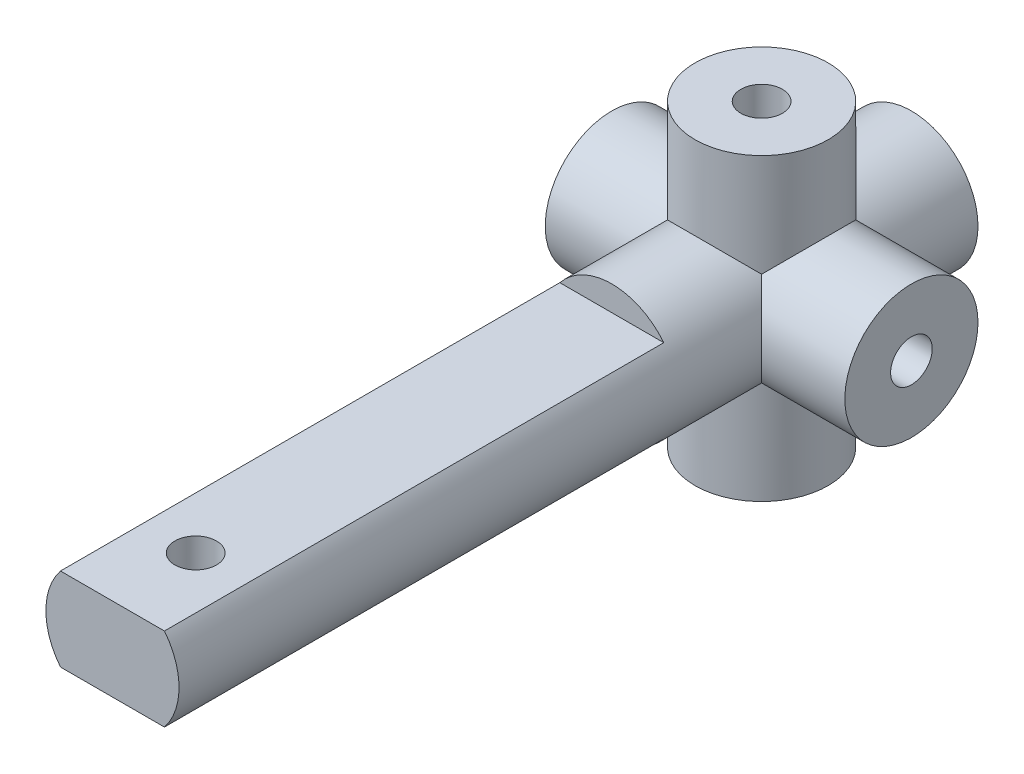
ISO-10303-21;
HEADER;
FILE_DESCRIPTION(('STEP AP214'),'2;1');
FILE_NAME('part.step','',(''),(''),'','','');
FILE_SCHEMA(('AUTOMOTIVE_DESIGN { 1 0 10303 214 1 1 1 1 }'));
ENDSEC;
DATA;
#1=APPLICATION_CONTEXT('core data for automotive mechanical design processes');
#2=APPLICATION_PROTOCOL_DEFINITION('international standard','automotive_design',2000,#1);
#3=PRODUCT_CONTEXT('',#1,'mechanical');
#4=PRODUCT('Part','Part','',(#3));
#5=PRODUCT_RELATED_PRODUCT_CATEGORY('part','',(#4));
#6=PRODUCT_DEFINITION_FORMATION('','',#4);
#7=PRODUCT_DEFINITION_CONTEXT('part definition',#1,'design');
#8=PRODUCT_DEFINITION('design','',#6,#7);
#9=PRODUCT_DEFINITION_SHAPE('','',#8);
#10=(LENGTH_UNIT() NAMED_UNIT(*) SI_UNIT(.MILLI.,.METRE.));
#11=(NAMED_UNIT(*) PLANE_ANGLE_UNIT() SI_UNIT($,.RADIAN.));
#12=(NAMED_UNIT(*) SI_UNIT($,.STERADIAN.) SOLID_ANGLE_UNIT());
#13=UNCERTAINTY_MEASURE_WITH_UNIT(LENGTH_MEASURE(1.E-05),#10,'distance_accuracy_value','');
#14=(GEOMETRIC_REPRESENTATION_CONTEXT(3) GLOBAL_UNCERTAINTY_ASSIGNED_CONTEXT((#13)) GLOBAL_UNIT_ASSIGNED_CONTEXT((#10,
#11,#12)) REPRESENTATION_CONTEXT('',''));
#15=CARTESIAN_POINT('',(0.,0.,0.));
#16=DIRECTION('',(0.,0.,1.));
#17=DIRECTION('',(1.,0.,0.));
#18=AXIS2_PLACEMENT_3D('',#15,#16,#17);
#19=CARTESIAN_POINT('',(0.,0.,9.));
#20=DIRECTION('',(0.,0.,-1.));
#21=DIRECTION('',(-1.,0.,0.));
#22=AXIS2_PLACEMENT_3D('',#19,#20,#21);
#23=CYLINDRICAL_SURFACE('',#22,4.);
#24=CARTESIAN_POINT('',(0.,0.,0.));
#25=DIRECTION('',(-0.707106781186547,0.,0.707106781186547));
#26=DIRECTION('',(-0.707106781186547,0.,-0.707106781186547));
#27=AXIS2_PLACEMENT_3D('',#24,#25,#26);
#28=ELLIPSE('',#27,5.65685424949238,4.);
#29=CARTESIAN_POINT('',(2.82842712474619,-2.82842712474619,2.82842712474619));
#30=VERTEX_POINT('',#29);
#31=CARTESIAN_POINT('',(2.82842712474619,2.82842712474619,2.82842712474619));
#32=VERTEX_POINT('',#31);
#33=EDGE_CURVE('E208',#30,#32,#28,.T.);
#34=ORIENTED_EDGE('',*,*,#33,.T.);
#35=CARTESIAN_POINT('',(0.,0.,0.));
#36=DIRECTION('',(0.,-0.707106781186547,0.707106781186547));
#37=DIRECTION('',(0.,-0.707106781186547,-0.707106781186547));
#38=AXIS2_PLACEMENT_3D('',#35,#36,#37);
#39=ELLIPSE('',#38,5.65685424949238,4.);
#40=CARTESIAN_POINT('',(-2.82842712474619,2.82842712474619,2.82842712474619));
#41=VERTEX_POINT('',#40);
#42=EDGE_CURVE('E214',#32,#41,#39,.T.);
#43=ORIENTED_EDGE('',*,*,#42,.T.);
#44=CARTESIAN_POINT('',(0.,0.,0.));
#45=DIRECTION('',(-0.707106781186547,0.,-0.707106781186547));
#46=DIRECTION('',(-0.707106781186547,0.,0.707106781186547));
#47=AXIS2_PLACEMENT_3D('',#44,#45,#46);
#48=ELLIPSE('',#47,5.65685424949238,4.);
#49=CARTESIAN_POINT('',(-2.82842712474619,-2.82842712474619,2.82842712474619));
#50=VERTEX_POINT('',#49);
#51=EDGE_CURVE('E211',#41,#50,#48,.F.);
#52=ORIENTED_EDGE('',*,*,#51,.T.);
#53=CARTESIAN_POINT('',(0.,0.,0.));
#54=DIRECTION('',(0.,-0.707106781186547,-0.707106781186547));
#55=DIRECTION('',(0.,-0.707106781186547,0.707106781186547));
#56=AXIS2_PLACEMENT_3D('',#53,#54,#55);
#57=ELLIPSE('',#56,5.65685424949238,4.);
#58=EDGE_CURVE('E205',#50,#30,#57,.F.);
#59=ORIENTED_EDGE('',*,*,#58,.T.);
#60=EDGE_LOOP('',(#34,#43,#52,#59));
#61=FACE_BOUND('',#60,.T.);
#62=DIRECTION('',(0.,0.,1.));
#63=VECTOR('',#62,1.);
#64=CARTESIAN_POINT('',(-3.1224989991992,-2.5,9.));
#65=LINE('',#64,#63);
#66=CARTESIAN_POINT('',(-3.1224989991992,-2.5,9.));
#67=VERTEX_POINT('',#66);
#68=CARTESIAN_POINT('',(-3.1224989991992,-2.5,39.));
#69=VERTEX_POINT('',#68);
#70=EDGE_CURVE('E123',#67,#69,#65,.T.);
#71=ORIENTED_EDGE('',*,*,#70,.T.);
#72=CARTESIAN_POINT('',(0.,0.,39.));
#73=DIRECTION('',(0.,0.,1.));
#74=DIRECTION('',(1.,0.,0.));
#75=AXIS2_PLACEMENT_3D('',#72,#73,#74);
#76=CIRCLE('',#75,4.);
#77=CARTESIAN_POINT('',(-3.1224989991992,2.5,39.));
#78=VERTEX_POINT('',#77);
#79=EDGE_CURVE('E159',#78,#69,#76,.T.);
#80=ORIENTED_EDGE('',*,*,#79,.F.);
#81=DIRECTION('',(0.,0.,1.));
#82=VECTOR('',#81,1.);
#83=CARTESIAN_POINT('',(-3.1224989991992,2.5,9.));
#84=LINE('',#83,#82);
#85=CARTESIAN_POINT('',(-3.1224989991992,2.5,9.));
#86=VERTEX_POINT('',#85);
#87=EDGE_CURVE('E58',#86,#78,#84,.T.);
#88=ORIENTED_EDGE('',*,*,#87,.F.);
#89=CARTESIAN_POINT('',(0.,0.,9.));
#90=DIRECTION('',(0.,0.,1.));
#91=DIRECTION('',(1.,0.,0.));
#92=AXIS2_PLACEMENT_3D('',#89,#90,#91);
#93=CIRCLE('',#92,4.);
#94=CARTESIAN_POINT('',(3.1224989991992,2.5,9.));
#95=VERTEX_POINT('',#94);
#96=EDGE_CURVE('E146',#95,#86,#93,.T.);
#97=ORIENTED_EDGE('',*,*,#96,.F.);
#98=DIRECTION('',(0.,0.,1.));
#99=VECTOR('',#98,1.);
#100=CARTESIAN_POINT('',(3.1224989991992,2.5,9.));
#101=LINE('',#100,#99);
#102=CARTESIAN_POINT('',(3.1224989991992,2.5,39.));
#103=VERTEX_POINT('',#102);
#104=EDGE_CURVE('E143',#95,#103,#101,.T.);
#105=ORIENTED_EDGE('',*,*,#104,.T.);
#106=CARTESIAN_POINT('',(3.1224989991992,-2.5,39.));
#107=VERTEX_POINT('',#106);
#108=EDGE_CURVE('E156',#107,#103,#76,.T.);
#109=ORIENTED_EDGE('',*,*,#108,.F.);
#110=DIRECTION('',(0.,0.,1.));
#111=VECTOR('',#110,1.);
#112=CARTESIAN_POINT('',(3.1224989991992,-2.5,9.));
#113=LINE('',#112,#111);
#114=CARTESIAN_POINT('',(3.1224989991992,-2.5,9.));
#115=VERTEX_POINT('',#114);
#116=EDGE_CURVE('E50',#115,#107,#113,.T.);
#117=ORIENTED_EDGE('',*,*,#116,.F.);
#118=CARTESIAN_POINT('',(0.,0.,9.));
#119=DIRECTION('',(0.,0.,1.));
#120=DIRECTION('',(1.,0.,0.));
#121=AXIS2_PLACEMENT_3D('',#118,#119,#120);
#122=CIRCLE('',#121,4.);
#123=EDGE_CURVE('E134',#67,#115,#122,.T.);
#124=ORIENTED_EDGE('',*,*,#123,.F.);
#125=EDGE_LOOP('',(#71,#80,#88,#97,#105,#109,#117,#124));
#126=FACE_BOUND('',#125,.T.);
#127=ADVANCED_FACE('F33',(#61,#126),#23,.T.);
#128=CARTESIAN_POINT('',(0.,0.,39.));
#129=DIRECTION('',(0.,0.,1.));
#130=DIRECTION('',(1.,0.,0.));
#131=AXIS2_PLACEMENT_3D('',#128,#129,#130);
#132=PLANE('',#131);
#133=ORIENTED_EDGE('',*,*,#79,.T.);
#134=DIRECTION('',(1.,0.,0.));
#135=VECTOR('',#134,1.);
#136=CARTESIAN_POINT('',(0.,-2.5,39.));
#137=LINE('',#136,#135);
#138=EDGE_CURVE('E129',#69,#107,#137,.T.);
#139=ORIENTED_EDGE('',*,*,#138,.T.);
#140=ORIENTED_EDGE('',*,*,#108,.T.);
#141=DIRECTION('',(1.,0.,0.));
#142=VECTOR('',#141,1.);
#143=CARTESIAN_POINT('',(0.,2.5,39.));
#144=LINE('',#143,#142);
#145=EDGE_CURVE('E149',#78,#103,#144,.T.);
#146=ORIENTED_EDGE('',*,*,#145,.F.);
#147=EDGE_LOOP('',(#133,#139,#140,#146));
#148=FACE_BOUND('',#147,.T.);
#149=ADVANCED_FACE('F276',(#148),#132,.T.);
#150=CARTESIAN_POINT('',(9.,0.,0.));
#151=DIRECTION('',(-1.,0.,0.));
#152=DIRECTION('',(0.,0.,1.));
#153=AXIS2_PLACEMENT_3D('',#150,#151,#152);
#154=CYLINDRICAL_SURFACE('',#153,1.25);
#155=CARTESIAN_POINT('',(-9.,0.,0.));
#156=DIRECTION('',(-1.,0.,0.));
#157=DIRECTION('',(0.,0.,1.));
#158=AXIS2_PLACEMENT_3D('',#155,#156,#157);
#159=CIRCLE('',#158,1.25);
#160=CARTESIAN_POINT('',(-9.,0.,1.25));
#161=VERTEX_POINT('',#160);
#162=EDGE_CURVE('E182',#161,#161,#159,.T.);
#163=ORIENTED_EDGE('',*,*,#162,.T.);
#164=EDGE_LOOP('',(#163));
#165=FACE_BOUND('',#164,.T.);
#166=CARTESIAN_POINT('',(0.,0.,0.));
#167=DIRECTION('',(-0.707106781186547,0.,0.707106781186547));
#168=DIRECTION('',(-0.707106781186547,0.,-0.707106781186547));
#169=AXIS2_PLACEMENT_3D('',#166,#167,#168);
#170=ELLIPSE('',#169,1.76776695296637,1.25);
#171=CARTESIAN_POINT('',(-0.883883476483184,-0.883883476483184,-0.883883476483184));
#172=VERTEX_POINT('',#171);
#173=CARTESIAN_POINT('',(-0.883883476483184,0.883883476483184,-0.883883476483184));
#174=VERTEX_POINT('',#173);
#175=EDGE_CURVE('E256',#172,#174,#170,.F.);
#176=ORIENTED_EDGE('',*,*,#175,.T.);
#177=CARTESIAN_POINT('',(0.,0.,0.));
#178=DIRECTION('',(-0.707106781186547,-0.707106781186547,0.));
#179=DIRECTION('',(-0.707106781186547,0.707106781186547,0.));
#180=AXIS2_PLACEMENT_3D('',#177,#178,#179);
#181=ELLIPSE('',#180,1.76776695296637,1.25);
#182=CARTESIAN_POINT('',(-0.883883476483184,0.883883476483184,0.883883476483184));
#183=VERTEX_POINT('',#182);
#184=EDGE_CURVE('E163',#174,#183,#181,.F.);
#185=ORIENTED_EDGE('',*,*,#184,.T.);
#186=CARTESIAN_POINT('',(0.,0.,0.));
#187=DIRECTION('',(-0.707106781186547,0.,-0.707106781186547));
#188=DIRECTION('',(-0.707106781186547,0.,0.707106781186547));
#189=AXIS2_PLACEMENT_3D('',#186,#187,#188);
#190=ELLIPSE('',#189,1.76776695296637,1.25);
#191=CARTESIAN_POINT('',(-0.883883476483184,-0.883883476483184,0.883883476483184));
#192=VERTEX_POINT('',#191);
#193=EDGE_CURVE('E245',#183,#192,#190,.F.);
#194=ORIENTED_EDGE('',*,*,#193,.T.);
#195=CARTESIAN_POINT('',(0.,0.,0.));
#196=DIRECTION('',(-0.707106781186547,0.707106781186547,0.));
#197=DIRECTION('',(-0.707106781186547,-0.707106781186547,0.));
#198=AXIS2_PLACEMENT_3D('',#195,#196,#197);
#199=ELLIPSE('',#198,1.76776695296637,1.25);
#200=EDGE_CURVE('E173',#192,#172,#199,.F.);
#201=ORIENTED_EDGE('',*,*,#200,.T.);
#202=EDGE_LOOP('',(#176,#185,#194,#201));
#203=FACE_BOUND('',#202,.T.);
#204=ADVANCED_FACE('F284',(#165,#203),#154,.F.);
#205=CARTESIAN_POINT('',(0.,9.,0.));
#206=DIRECTION('',(0.,-1.,0.));
#207=DIRECTION('',(0.,0.,-1.));
#208=AXIS2_PLACEMENT_3D('',#205,#206,#207);
#209=CYLINDRICAL_SURFACE('',#208,4.);
#210=CARTESIAN_POINT('',(0.,9.,0.));
#211=DIRECTION('',(0.,1.,0.));
#212=DIRECTION('',(0.,0.,1.));
#213=AXIS2_PLACEMENT_3D('',#210,#211,#212);
#214=CIRCLE('',#213,4.);
#215=CARTESIAN_POINT('',(0.,9.,4.));
#216=VERTEX_POINT('',#215);
#217=EDGE_CURVE('E242',#216,#216,#214,.T.);
#218=ORIENTED_EDGE('',*,*,#217,.F.);
#219=EDGE_LOOP('',(#218));
#220=FACE_BOUND('',#219,.T.);
#221=CARTESIAN_POINT('',(0.,0.,0.));
#222=DIRECTION('',(0.,-0.707106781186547,-0.707106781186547));
#223=DIRECTION('',(0.,-0.707106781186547,0.707106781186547));
#224=AXIS2_PLACEMENT_3D('',#221,#222,#223);
#225=ELLIPSE('',#224,5.65685424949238,4.);
#226=CARTESIAN_POINT('',(-2.82842712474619,2.82842712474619,-2.82842712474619));
#227=VERTEX_POINT('',#226);
#228=CARTESIAN_POINT('',(2.82842712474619,2.82842712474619,-2.82842712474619));
#229=VERTEX_POINT('',#228);
#230=EDGE_CURVE('E202',#227,#229,#225,.T.);
#231=ORIENTED_EDGE('',*,*,#230,.F.);
#232=CARTESIAN_POINT('',(0.,0.,0.));
#233=DIRECTION('',(-0.707106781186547,-0.707106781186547,0.));
#234=DIRECTION('',(0.707106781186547,-0.707106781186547,0.));
#235=AXIS2_PLACEMENT_3D('',#232,#233,#234);
#236=ELLIPSE('',#235,5.65685424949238,4.);
#237=EDGE_CURVE('E229',#41,#227,#236,.T.);
#238=ORIENTED_EDGE('',*,*,#237,.F.);
#239=ORIENTED_EDGE('',*,*,#42,.F.);
#240=CARTESIAN_POINT('',(0.,0.,0.));
#241=DIRECTION('',(0.707106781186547,-0.707106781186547,0.));
#242=DIRECTION('',(-0.707106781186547,-0.707106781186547,0.));
#243=AXIS2_PLACEMENT_3D('',#240,#241,#242);
#244=ELLIPSE('',#243,5.65685424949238,4.);
#245=EDGE_CURVE('E226',#229,#32,#244,.T.);
#246=ORIENTED_EDGE('',*,*,#245,.F.);
#247=EDGE_LOOP('',(#231,#238,#239,#246));
#248=FACE_BOUND('',#247,.T.);
#249=ADVANCED_FACE('F35',(#220,#248),#209,.T.);
#250=CARTESIAN_POINT('',(0.,9.,0.));
#251=DIRECTION('',(0.,-1.,0.));
#252=DIRECTION('',(0.,0.,-1.));
#253=AXIS2_PLACEMENT_3D('',#250,#251,#252);
#254=CYLINDRICAL_SURFACE('',#253,1.25);
#255=CARTESIAN_POINT('',(0.,9.,0.));
#256=DIRECTION('',(0.,1.,0.));
#257=DIRECTION('',(0.,0.,1.));
#258=AXIS2_PLACEMENT_3D('',#255,#256,#257);
#259=CIRCLE('',#258,1.25);
#260=CARTESIAN_POINT('',(0.,9.,1.25));
#261=VERTEX_POINT('',#260);
#262=EDGE_CURVE('E236',#261,#261,#259,.T.);
#263=ORIENTED_EDGE('',*,*,#262,.T.);
#264=EDGE_LOOP('',(#263));
#265=FACE_BOUND('',#264,.T.);
#266=ORIENTED_EDGE('',*,*,#184,.F.);
#267=CARTESIAN_POINT('',(0.,0.,0.));
#268=DIRECTION('',(0.,0.707106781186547,0.707106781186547));
#269=DIRECTION('',(0.,-0.707106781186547,0.707106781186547));
#270=AXIS2_PLACEMENT_3D('',#267,#268,#269);
#271=ELLIPSE('',#270,1.76776695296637,1.25);
#272=CARTESIAN_POINT('',(0.883883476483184,0.883883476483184,-0.883883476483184));
#273=VERTEX_POINT('',#272);
#274=EDGE_CURVE('E42',#273,#174,#271,.T.);
#275=ORIENTED_EDGE('',*,*,#274,.F.);
#276=CARTESIAN_POINT('',(0.,0.,0.));
#277=DIRECTION('',(-0.707106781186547,0.707106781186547,0.));
#278=DIRECTION('',(-0.707106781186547,-0.707106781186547,0.));
#279=AXIS2_PLACEMENT_3D('',#276,#277,#278);
#280=ELLIPSE('',#279,1.76776695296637,1.25);
#281=CARTESIAN_POINT('',(0.883883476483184,0.883883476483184,0.883883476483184));
#282=VERTEX_POINT('',#281);
#283=EDGE_CURVE('E160',#282,#273,#280,.T.);
#284=ORIENTED_EDGE('',*,*,#283,.F.);
#285=CARTESIAN_POINT('',(0.,0.,0.));
#286=DIRECTION('',(0.,-0.707106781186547,0.707106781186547));
#287=DIRECTION('',(0.,0.707106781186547,0.707106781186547));
#288=AXIS2_PLACEMENT_3D('',#285,#286,#287);
#289=ELLIPSE('',#288,1.76776695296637,1.25);
#290=EDGE_CURVE('E167',#183,#282,#289,.F.);
#291=ORIENTED_EDGE('',*,*,#290,.F.);
#292=EDGE_LOOP('',(#266,#275,#284,#291));
#293=FACE_BOUND('',#292,.T.);
#294=ADVANCED_FACE('F325',(#265,#293),#254,.F.);
#295=CARTESIAN_POINT('',(9.,0.,0.));
#296=DIRECTION('',(-1.,0.,0.));
#297=DIRECTION('',(0.,0.,1.));
#298=AXIS2_PLACEMENT_3D('',#295,#296,#297);
#299=CYLINDRICAL_SURFACE('',#298,4.);
#300=CARTESIAN_POINT('',(-9.,0.,0.));
#301=DIRECTION('',(1.,0.,0.));
#302=DIRECTION('',(0.,0.,-1.));
#303=AXIS2_PLACEMENT_3D('',#300,#301,#302);
#304=CIRCLE('',#303,4.);
#305=CARTESIAN_POINT('',(-9.,0.,-4.));
#306=VERTEX_POINT('',#305);
#307=EDGE_CURVE('E217',#306,#306,#304,.T.);
#308=ORIENTED_EDGE('',*,*,#307,.T.);
#309=EDGE_LOOP('',(#308));
#310=FACE_BOUND('',#309,.T.);
#311=ORIENTED_EDGE('',*,*,#51,.F.);
#312=ORIENTED_EDGE('',*,*,#237,.T.);
#313=CARTESIAN_POINT('',(0.,0.,0.));
#314=DIRECTION('',(-0.707106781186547,0.,0.707106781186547));
#315=DIRECTION('',(-0.707106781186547,0.,-0.707106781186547));
#316=AXIS2_PLACEMENT_3D('',#313,#314,#315);
#317=ELLIPSE('',#316,5.65685424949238,4.);
#318=CARTESIAN_POINT('',(-2.82842712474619,-2.82842712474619,-2.82842712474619));
#319=VERTEX_POINT('',#318);
#320=EDGE_CURVE('E199',#319,#227,#317,.F.);
#321=ORIENTED_EDGE('',*,*,#320,.F.);
#322=CARTESIAN_POINT('',(0.,0.,0.));
#323=DIRECTION('',(0.707106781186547,-0.707106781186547,0.));
#324=DIRECTION('',(-0.707106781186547,-0.707106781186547,0.));
#325=AXIS2_PLACEMENT_3D('',#322,#323,#324);
#326=ELLIPSE('',#325,5.65685424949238,4.);
#327=EDGE_CURVE('E221',#319,#50,#326,.F.);
#328=ORIENTED_EDGE('',*,*,#327,.T.);
#329=EDGE_LOOP('',(#311,#312,#321,#328));
#330=FACE_BOUND('',#329,.T.);
#331=ADVANCED_FACE('F306',(#310,#330),#299,.T.);
#332=CARTESIAN_POINT('',(9.,0.,0.));
#333=DIRECTION('',(1.,0.,0.));
#334=DIRECTION('',(0.,0.,-1.));
#335=AXIS2_PLACEMENT_3D('',#332,#333,#334);
#336=CIRCLE('',#335,4.);
#337=CARTESIAN_POINT('',(9.,0.,-4.));
#338=VERTEX_POINT('',#337);
#339=EDGE_CURVE('E218',#338,#338,#336,.T.);
#340=ORIENTED_EDGE('',*,*,#339,.F.);
#341=EDGE_LOOP('',(#340));
#342=FACE_BOUND('',#341,.T.);
#343=CARTESIAN_POINT('',(0.,0.,0.));
#344=DIRECTION('',(-0.707106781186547,0.,-0.707106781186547));
#345=DIRECTION('',(-0.707106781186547,0.,0.707106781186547));
#346=AXIS2_PLACEMENT_3D('',#343,#344,#345);
#347=ELLIPSE('',#346,5.65685424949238,4.);
#348=CARTESIAN_POINT('',(2.82842712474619,-2.82842712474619,-2.82842712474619));
#349=VERTEX_POINT('',#348);
#350=EDGE_CURVE('E196',#229,#349,#347,.T.);
#351=ORIENTED_EDGE('',*,*,#350,.F.);
#352=ORIENTED_EDGE('',*,*,#245,.T.);
#353=ORIENTED_EDGE('',*,*,#33,.F.);
#354=CARTESIAN_POINT('',(0.,0.,0.));
#355=DIRECTION('',(-0.707106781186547,-0.707106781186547,0.));
#356=DIRECTION('',(0.707106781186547,-0.707106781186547,0.));
#357=AXIS2_PLACEMENT_3D('',#354,#355,#356);
#358=ELLIPSE('',#357,5.65685424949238,4.);
#359=EDGE_CURVE('E232',#30,#349,#358,.F.);
#360=ORIENTED_EDGE('',*,*,#359,.T.);
#361=EDGE_LOOP('',(#351,#352,#353,#360));
#362=FACE_BOUND('',#361,.T.);
#363=ADVANCED_FACE('F312',(#342,#362),#299,.T.);
#364=CARTESIAN_POINT('',(0.,-9.,0.));
#365=DIRECTION('',(0.,1.,0.));
#366=DIRECTION('',(0.,0.,1.));
#367=AXIS2_PLACEMENT_3D('',#364,#365,#366);
#368=CIRCLE('',#367,4.);
#369=CARTESIAN_POINT('',(0.,-9.,4.));
#370=VERTEX_POINT('',#369);
#371=EDGE_CURVE('E239',#370,#370,#368,.T.);
#372=ORIENTED_EDGE('',*,*,#371,.T.);
#373=EDGE_LOOP('',(#372));
#374=FACE_BOUND('',#373,.T.);
#375=ORIENTED_EDGE('',*,*,#58,.F.);
#376=ORIENTED_EDGE('',*,*,#327,.F.);
#377=CARTESIAN_POINT('',(0.,0.,0.));
#378=DIRECTION('',(0.,-0.707106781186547,0.707106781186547));
#379=DIRECTION('',(0.,-0.707106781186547,-0.707106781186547));
#380=AXIS2_PLACEMENT_3D('',#377,#378,#379);
#381=ELLIPSE('',#380,5.65685424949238,4.);
#382=EDGE_CURVE('E193',#349,#319,#381,.F.);
#383=ORIENTED_EDGE('',*,*,#382,.F.);
#384=ORIENTED_EDGE('',*,*,#359,.F.);
#385=EDGE_LOOP('',(#375,#376,#383,#384));
#386=FACE_BOUND('',#385,.T.);
#387=ADVANCED_FACE('F314',(#374,#386),#209,.T.);
#388=CARTESIAN_POINT('',(0.,-9.,0.));
#389=DIRECTION('',(0.,1.,0.));
#390=DIRECTION('',(0.,0.,1.));
#391=AXIS2_PLACEMENT_3D('',#388,#389,#390);
#392=CIRCLE('',#391,1.25);
#393=CARTESIAN_POINT('',(0.,-9.,1.25));
#394=VERTEX_POINT('',#393);
#395=EDGE_CURVE('E235',#394,#394,#392,.T.);
#396=ORIENTED_EDGE('',*,*,#395,.F.);
#397=EDGE_LOOP('',(#396));
#398=FACE_BOUND('',#397,.T.);
#399=CARTESIAN_POINT('',(0.,0.,0.));
#400=DIRECTION('',(-0.707106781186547,-0.707106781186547,0.));
#401=DIRECTION('',(-0.707106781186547,0.707106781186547,0.));
#402=AXIS2_PLACEMENT_3D('',#399,#400,#401);
#403=ELLIPSE('',#402,1.76776695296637,1.25);
#404=CARTESIAN_POINT('',(0.883883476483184,-0.883883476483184,-0.883883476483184));
#405=VERTEX_POINT('',#404);
#406=CARTESIAN_POINT('',(0.883883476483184,-0.883883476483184,0.883883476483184));
#407=VERTEX_POINT('',#406);
#408=EDGE_CURVE('E170',#405,#407,#403,.T.);
#409=ORIENTED_EDGE('',*,*,#408,.F.);
#410=CARTESIAN_POINT('',(0.,0.,0.));
#411=DIRECTION('',(0.,-0.707106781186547,0.707106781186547));
#412=DIRECTION('',(0.,0.707106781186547,0.707106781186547));
#413=AXIS2_PLACEMENT_3D('',#410,#411,#412);
#414=ELLIPSE('',#413,1.76776695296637,1.25);
#415=EDGE_CURVE('E11',#172,#405,#414,.T.);
#416=ORIENTED_EDGE('',*,*,#415,.F.);
#417=ORIENTED_EDGE('',*,*,#200,.F.);
#418=CARTESIAN_POINT('',(0.,0.,0.));
#419=DIRECTION('',(0.,0.707106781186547,0.707106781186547));
#420=DIRECTION('',(0.,-0.707106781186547,0.707106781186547));
#421=AXIS2_PLACEMENT_3D('',#418,#419,#420);
#422=ELLIPSE('',#421,1.76776695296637,1.25);
#423=EDGE_CURVE('E176',#407,#192,#422,.F.);
#424=ORIENTED_EDGE('',*,*,#423,.F.);
#425=EDGE_LOOP('',(#409,#416,#417,#424));
#426=FACE_BOUND('',#425,.T.);
#427=ADVANCED_FACE('F316',(#398,#426),#254,.F.);
#428=CARTESIAN_POINT('',(0.,9.,0.));
#429=DIRECTION('',(0.,1.,0.));
#430=DIRECTION('',(0.,0.,1.));
#431=AXIS2_PLACEMENT_3D('',#428,#429,#430);
#432=PLANE('',#431);
#433=ORIENTED_EDGE('',*,*,#217,.T.);
#434=EDGE_LOOP('',(#433));
#435=FACE_BOUND('',#434,.T.);
#436=ORIENTED_EDGE('',*,*,#262,.F.);
#437=EDGE_LOOP('',(#436));
#438=FACE_BOUND('',#437,.T.);
#439=ADVANCED_FACE('F322',(#435,#438),#432,.T.);
#440=CARTESIAN_POINT('',(-9.,0.,0.));
#441=DIRECTION('',(1.,0.,0.));
#442=DIRECTION('',(0.,0.,-1.));
#443=AXIS2_PLACEMENT_3D('',#440,#441,#442);
#444=PLANE('',#443);
#445=ORIENTED_EDGE('',*,*,#162,.F.);
#446=EDGE_LOOP('',(#445));
#447=FACE_BOUND('',#446,.T.);
#448=ORIENTED_EDGE('',*,*,#307,.F.);
#449=EDGE_LOOP('',(#448));
#450=FACE_BOUND('',#449,.T.);
#451=ADVANCED_FACE('F341',(#447,#450),#444,.F.);
#452=CARTESIAN_POINT('',(9.,0.,0.));
#453=DIRECTION('',(1.,0.,0.));
#454=DIRECTION('',(0.,0.,-1.));
#455=AXIS2_PLACEMENT_3D('',#452,#453,#454);
#456=PLANE('',#455);
#457=CARTESIAN_POINT('',(9.,0.,0.));
#458=DIRECTION('',(-1.,0.,0.));
#459=DIRECTION('',(0.,0.,1.));
#460=AXIS2_PLACEMENT_3D('',#457,#458,#459);
#461=CIRCLE('',#460,1.25);
#462=CARTESIAN_POINT('',(9.,0.,1.25));
#463=VERTEX_POINT('',#462);
#464=EDGE_CURVE('E185',#463,#463,#461,.T.);
#465=ORIENTED_EDGE('',*,*,#464,.T.);
#466=EDGE_LOOP('',(#465));
#467=FACE_BOUND('',#466,.T.);
#468=ORIENTED_EDGE('',*,*,#339,.T.);
#469=EDGE_LOOP('',(#468));
#470=FACE_BOUND('',#469,.T.);
#471=ADVANCED_FACE('F357',(#467,#470),#456,.T.);
#472=CARTESIAN_POINT('',(0.,-9.,0.));
#473=DIRECTION('',(0.,1.,0.));
#474=DIRECTION('',(0.,0.,1.));
#475=AXIS2_PLACEMENT_3D('',#472,#473,#474);
#476=PLANE('',#475);
#477=ORIENTED_EDGE('',*,*,#371,.F.);
#478=EDGE_LOOP('',(#477));
#479=FACE_BOUND('',#478,.T.);
#480=ORIENTED_EDGE('',*,*,#395,.T.);
#481=EDGE_LOOP('',(#480));
#482=FACE_BOUND('',#481,.T.);
#483=ADVANCED_FACE('F300',(#479,#482),#476,.F.);
#484=CARTESIAN_POINT('',(0.,0.,-9.));
#485=DIRECTION('',(0.,0.,1.));
#486=DIRECTION('',(1.,0.,0.));
#487=AXIS2_PLACEMENT_3D('',#484,#485,#486);
#488=PLANE('',#487);
#489=CARTESIAN_POINT('',(0.,0.,-9.));
#490=DIRECTION('',(0.,0.,1.));
#491=DIRECTION('',(1.,0.,0.));
#492=AXIS2_PLACEMENT_3D('',#489,#490,#491);
#493=CIRCLE('',#492,1.25);
#494=CARTESIAN_POINT('',(1.25,0.,-9.));
#495=VERTEX_POINT('',#494);
#496=EDGE_CURVE('E179',#495,#495,#493,.T.);
#497=ORIENTED_EDGE('',*,*,#496,.T.);
#498=EDGE_LOOP('',(#497));
#499=FACE_BOUND('',#498,.T.);
#500=CARTESIAN_POINT('',(0.,0.,-9.));
#501=DIRECTION('',(0.,0.,1.));
#502=DIRECTION('',(1.,0.,0.));
#503=AXIS2_PLACEMENT_3D('',#500,#501,#502);
#504=CIRCLE('',#503,4.);
#505=CARTESIAN_POINT('',(4.,0.,-9.));
#506=VERTEX_POINT('',#505);
#507=EDGE_CURVE('E188',#506,#506,#504,.T.);
#508=ORIENTED_EDGE('',*,*,#507,.F.);
#509=EDGE_LOOP('',(#508));
#510=FACE_BOUND('',#509,.T.);
#511=ADVANCED_FACE('F290',(#499,#510),#488,.F.);
#512=ORIENTED_EDGE('',*,*,#507,.T.);
#513=EDGE_LOOP('',(#512));
#514=FACE_BOUND('',#513,.T.);
#515=ORIENTED_EDGE('',*,*,#320,.T.);
#516=ORIENTED_EDGE('',*,*,#230,.T.);
#517=ORIENTED_EDGE('',*,*,#350,.T.);
#518=ORIENTED_EDGE('',*,*,#382,.T.);
#519=EDGE_LOOP('',(#515,#516,#517,#518));
#520=FACE_BOUND('',#519,.T.);
#521=ADVANCED_FACE('F279',(#514,#520),#23,.T.);
#522=CARTESIAN_POINT('',(0.,0.,0.));
#523=DIRECTION('',(-0.707106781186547,0.,-0.707106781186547));
#524=DIRECTION('',(-0.707106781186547,0.,0.707106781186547));
#525=AXIS2_PLACEMENT_3D('',#522,#523,#524);
#526=ELLIPSE('',#525,1.76776695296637,1.25);
#527=EDGE_CURVE('E250',#273,#405,#526,.T.);
#528=ORIENTED_EDGE('',*,*,#527,.T.);
#529=ORIENTED_EDGE('',*,*,#408,.T.);
#530=CARTESIAN_POINT('',(0.,0.,0.));
#531=DIRECTION('',(-0.707106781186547,0.,0.707106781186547));
#532=DIRECTION('',(-0.707106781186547,0.,-0.707106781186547));
#533=AXIS2_PLACEMENT_3D('',#530,#531,#532);
#534=ELLIPSE('',#533,1.76776695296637,1.25);
#535=EDGE_CURVE('E253',#407,#282,#534,.T.);
#536=ORIENTED_EDGE('',*,*,#535,.T.);
#537=ORIENTED_EDGE('',*,*,#283,.T.);
#538=EDGE_LOOP('',(#528,#529,#536,#537));
#539=FACE_BOUND('',#538,.T.);
#540=ORIENTED_EDGE('',*,*,#464,.F.);
#541=EDGE_LOOP('',(#540));
#542=FACE_BOUND('',#541,.T.);
#543=ADVANCED_FACE('F289',(#539,#542),#154,.F.);
#544=CARTESIAN_POINT('',(0.,0.,-9.));
#545=DIRECTION('',(0.,0.,1.));
#546=DIRECTION('',(1.,0.,0.));
#547=AXIS2_PLACEMENT_3D('',#544,#545,#546);
#548=CYLINDRICAL_SURFACE('',#547,1.25);
#549=CARTESIAN_POINT('',(0.,0.,9.));
#550=DIRECTION('',(0.,0.,1.));
#551=DIRECTION('',(1.,0.,0.));
#552=AXIS2_PLACEMENT_3D('',#549,#550,#551);
#553=CIRCLE('',#552,1.25);
#554=CARTESIAN_POINT('',(1.25,0.,9.));
#555=VERTEX_POINT('',#554);
#556=EDGE_CURVE('E164',#555,#555,#553,.T.);
#557=ORIENTED_EDGE('',*,*,#556,.T.);
#558=EDGE_LOOP('',(#557));
#559=FACE_BOUND('',#558,.T.);
#560=ORIENTED_EDGE('',*,*,#193,.F.);
#561=ORIENTED_EDGE('',*,*,#290,.T.);
#562=ORIENTED_EDGE('',*,*,#535,.F.);
#563=ORIENTED_EDGE('',*,*,#423,.T.);
#564=EDGE_LOOP('',(#560,#561,#562,#563));
#565=FACE_BOUND('',#564,.T.);
#566=ADVANCED_FACE('F297',(#559,#565),#548,.F.);
#567=ORIENTED_EDGE('',*,*,#496,.F.);
#568=EDGE_LOOP('',(#567));
#569=FACE_BOUND('',#568,.T.);
#570=ORIENTED_EDGE('',*,*,#175,.F.);
#571=ORIENTED_EDGE('',*,*,#415,.T.);
#572=ORIENTED_EDGE('',*,*,#527,.F.);
#573=ORIENTED_EDGE('',*,*,#274,.T.);
#574=EDGE_LOOP('',(#570,#571,#572,#573));
#575=FACE_BOUND('',#574,.T.);
#576=ADVANCED_FACE('F350',(#569,#575),#548,.F.);
#577=CARTESIAN_POINT('',(0.,0.,9.));
#578=DIRECTION('',(0.,0.,1.));
#579=DIRECTION('',(1.,0.,0.));
#580=AXIS2_PLACEMENT_3D('',#577,#578,#579);
#581=PLANE('',#580);
#582=ORIENTED_EDGE('',*,*,#556,.F.);
#583=EDGE_LOOP('',(#582));
#584=FACE_BOUND('',#583,.T.);
#585=ADVANCED_FACE('F440',(#584),#581,.F.);
#586=CARTESIAN_POINT('',(0.,2.5,9.));
#587=DIRECTION('',(0.,-1.,0.));
#588=DIRECTION('',(0.,0.,-1.));
#589=AXIS2_PLACEMENT_3D('',#586,#587,#588);
#590=PLANE('',#589);
#591=ORIENTED_EDGE('',*,*,#145,.T.);
#592=ORIENTED_EDGE('',*,*,#104,.F.);
#593=DIRECTION('',(1.,0.,0.));
#594=VECTOR('',#593,1.);
#595=CARTESIAN_POINT('',(0.,2.5,9.));
#596=LINE('',#595,#594);
#597=EDGE_CURVE('E148',#86,#95,#596,.T.);
#598=ORIENTED_EDGE('',*,*,#597,.F.);
#599=ORIENTED_EDGE('',*,*,#87,.T.);
#600=EDGE_LOOP('',(#591,#592,#598,#599));
#601=FACE_BOUND('',#600,.T.);
#602=CARTESIAN_POINT('',(0.,2.5,34.000572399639));
#603=DIRECTION('',(0.,-1.,0.));
#604=DIRECTION('',(0.,0.,-1.));
#605=AXIS2_PLACEMENT_3D('',#602,#603,#604);
#606=CIRCLE('',#605,1.25);
#607=CARTESIAN_POINT('',(0.,2.5,32.750572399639));
#608=VERTEX_POINT('',#607);
#609=EDGE_CURVE('E144',#608,#608,#606,.F.);
#610=ORIENTED_EDGE('',*,*,#609,.F.);
#611=EDGE_LOOP('',(#610));
#612=FACE_BOUND('',#611,.T.);
#613=ADVANCED_FACE('F445',(#601,#612),#590,.F.);
#614=CARTESIAN_POINT('',(0.,0.,9.));
#615=DIRECTION('',(0.,0.,1.));
#616=DIRECTION('',(1.,0.,0.));
#617=AXIS2_PLACEMENT_3D('',#614,#615,#616);
#618=PLANE('',#617);
#619=ORIENTED_EDGE('',*,*,#96,.T.);
#620=ORIENTED_EDGE('',*,*,#597,.T.);
#621=EDGE_LOOP('',(#619,#620));
#622=FACE_BOUND('',#621,.T.);
#623=ADVANCED_FACE('F468',(#622),#618,.T.);
#624=CARTESIAN_POINT('',(0.,-2.5,9.));
#625=DIRECTION('',(0.,-1.,0.));
#626=DIRECTION('',(0.,0.,-1.));
#627=AXIS2_PLACEMENT_3D('',#624,#625,#626);
#628=PLANE('',#627);
#629=ORIENTED_EDGE('',*,*,#138,.F.);
#630=ORIENTED_EDGE('',*,*,#70,.F.);
#631=DIRECTION('',(1.,0.,0.));
#632=VECTOR('',#631,1.);
#633=CARTESIAN_POINT('',(0.,-2.5,9.));
#634=LINE('',#633,#632);
#635=EDGE_CURVE('E127',#67,#115,#634,.T.);
#636=ORIENTED_EDGE('',*,*,#635,.T.);
#637=ORIENTED_EDGE('',*,*,#116,.T.);
#638=EDGE_LOOP('',(#629,#630,#636,#637));
#639=FACE_BOUND('',#638,.T.);
#640=CARTESIAN_POINT('',(0.,-2.5,34.000572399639));
#641=DIRECTION('',(0.,-1.,0.));
#642=DIRECTION('',(0.,0.,-1.));
#643=AXIS2_PLACEMENT_3D('',#640,#641,#642);
#644=CIRCLE('',#643,1.25);
#645=CARTESIAN_POINT('',(0.,-2.5,32.750572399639));
#646=VERTEX_POINT('',#645);
#647=EDGE_CURVE('E37',#646,#646,#644,.F.);
#648=ORIENTED_EDGE('',*,*,#647,.T.);
#649=EDGE_LOOP('',(#648));
#650=FACE_BOUND('',#649,.T.);
#651=ADVANCED_FACE('F125',(#639,#650),#628,.T.);
#652=CARTESIAN_POINT('',(0.,0.,9.));
#653=DIRECTION('',(0.,0.,1.));
#654=DIRECTION('',(1.,0.,0.));
#655=AXIS2_PLACEMENT_3D('',#652,#653,#654);
#656=PLANE('',#655);
#657=ORIENTED_EDGE('',*,*,#635,.F.);
#658=ORIENTED_EDGE('',*,*,#123,.T.);
#659=EDGE_LOOP('',(#657,#658));
#660=FACE_BOUND('',#659,.T.);
#661=ADVANCED_FACE('F137',(#660),#656,.T.);
#662=CARTESIAN_POINT('',(0.,21.,34.000572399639));
#663=DIRECTION('',(0.,-1.,0.));
#664=DIRECTION('',(0.,0.,-1.));
#665=AXIS2_PLACEMENT_3D('',#662,#663,#664);
#666=CYLINDRICAL_SURFACE('',#665,1.25);
#667=ORIENTED_EDGE('',*,*,#609,.T.);
#668=EDGE_LOOP('',(#667));
#669=FACE_BOUND('',#668,.T.);
#670=ORIENTED_EDGE('',*,*,#647,.F.);
#671=EDGE_LOOP('',(#670));
#672=FACE_BOUND('',#671,.T.);
#673=ADVANCED_FACE('F266',(#669,#672),#666,.F.);
#674=CLOSED_SHELL('',(#127,#149,#204,#249,#294,#331,#363,#387,#427,#439,#451,#471,#483,#511,
#521,#543,#566,#576,#585,#613,#623,#651,#661,#673));
#675=MANIFOLD_SOLID_BREP('B2',#674);
#676=ADVANCED_BREP_SHAPE_REPRESENTATION('',(#18,#675),#14);
#677=SHAPE_DEFINITION_REPRESENTATION(#9,#676);
ENDSEC;
END-ISO-10303-21;
